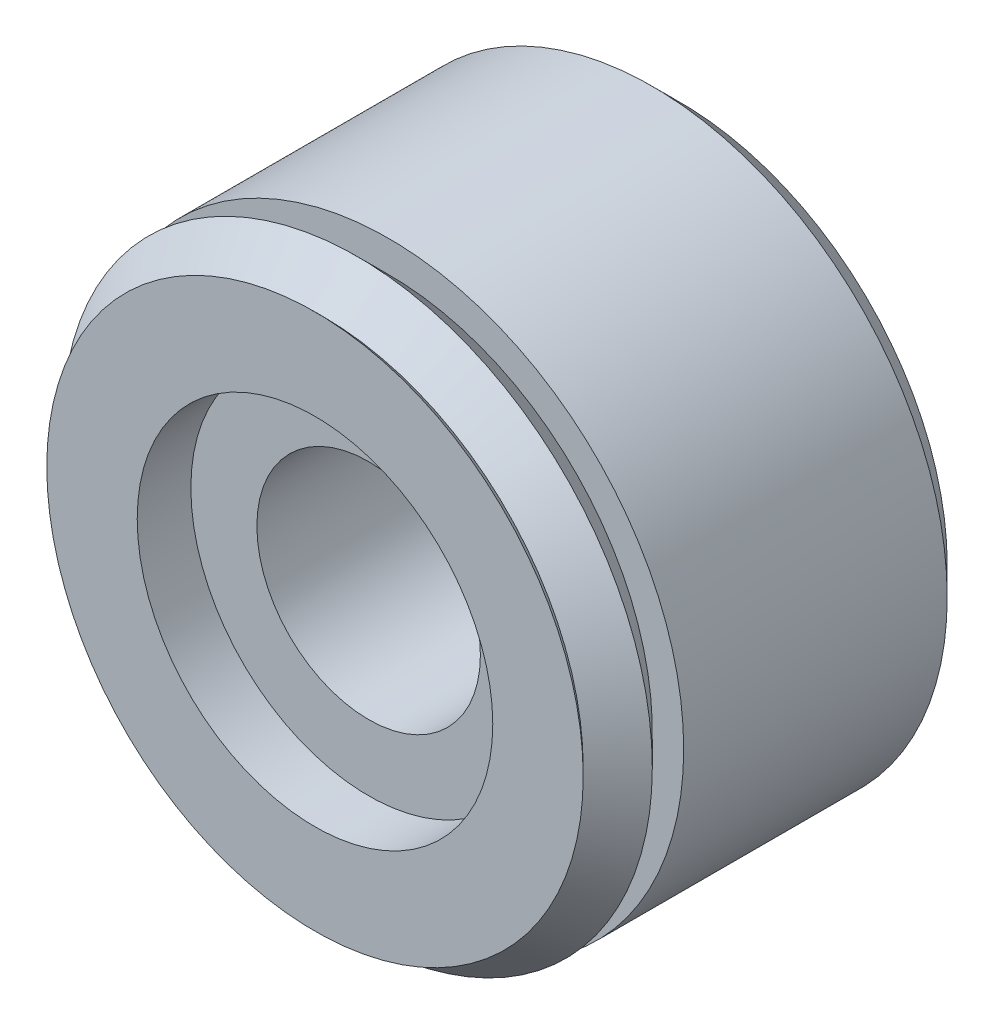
ISO-10303-21;
HEADER;
FILE_DESCRIPTION(('STEP AP214'),'2;1');
FILE_NAME('part.step','',(''),(''),'','','');
FILE_SCHEMA(('AUTOMOTIVE_DESIGN { 1 0 10303 214 1 1 1 1 }'));
ENDSEC;
DATA;
#1=APPLICATION_CONTEXT('core data for automotive mechanical design processes');
#2=APPLICATION_PROTOCOL_DEFINITION('international standard','automotive_design',2000,#1);
#3=PRODUCT_CONTEXT('',#1,'mechanical');
#4=PRODUCT('Part','Part','',(#3));
#5=PRODUCT_RELATED_PRODUCT_CATEGORY('part','',(#4));
#6=PRODUCT_DEFINITION_FORMATION('','',#4);
#7=PRODUCT_DEFINITION_CONTEXT('part definition',#1,'design');
#8=PRODUCT_DEFINITION('design','',#6,#7);
#9=PRODUCT_DEFINITION_SHAPE('','',#8);
#10=(LENGTH_UNIT() NAMED_UNIT(*) SI_UNIT(.MILLI.,.METRE.));
#11=(NAMED_UNIT(*) PLANE_ANGLE_UNIT() SI_UNIT($,.RADIAN.));
#12=(NAMED_UNIT(*) SI_UNIT($,.STERADIAN.) SOLID_ANGLE_UNIT());
#13=UNCERTAINTY_MEASURE_WITH_UNIT(LENGTH_MEASURE(1.E-05),#10,'distance_accuracy_value','');
#14=(GEOMETRIC_REPRESENTATION_CONTEXT(3) GLOBAL_UNCERTAINTY_ASSIGNED_CONTEXT((#13)) GLOBAL_UNIT_ASSIGNED_CONTEXT((#10,
#11,#12)) REPRESENTATION_CONTEXT('',''));
#15=CARTESIAN_POINT('',(0.,0.,0.));
#16=DIRECTION('',(0.,0.,1.));
#17=DIRECTION('',(1.,0.,0.));
#18=AXIS2_PLACEMENT_3D('',#15,#16,#17);
#19=CARTESIAN_POINT('',(0.,0.,-10.373614));
#20=DIRECTION('',(0.,0.,1.));
#21=DIRECTION('',(1.,0.,0.));
#22=AXIS2_PLACEMENT_3D('',#19,#20,#21);
#23=CYLINDRICAL_SURFACE('',#22,3.175);
#24=CARTESIAN_POINT('',(0.,0.,-10.373614));
#25=DIRECTION('',(0.,0.,-1.));
#26=DIRECTION('',(-1.,0.,0.));
#27=AXIS2_PLACEMENT_3D('',#24,#25,#26);
#28=CIRCLE('',#27,3.175);
#29=CARTESIAN_POINT('',(-3.175,0.,-10.373614));
#30=VERTEX_POINT('',#29);
#31=EDGE_CURVE('E62',#30,#30,#28,.T.);
#32=ORIENTED_EDGE('',*,*,#31,.T.);
#33=EDGE_LOOP('',(#32));
#34=FACE_BOUND('',#33,.T.);
#35=CARTESIAN_POINT('',(0.,0.,-1.524));
#36=DIRECTION('',(0.,0.,1.));
#37=DIRECTION('',(1.,0.,0.));
#38=AXIS2_PLACEMENT_3D('',#35,#36,#37);
#39=CIRCLE('',#38,3.175);
#40=CARTESIAN_POINT('',(3.175,0.,-1.524));
#41=VERTEX_POINT('',#40);
#42=EDGE_CURVE('E37',#41,#41,#39,.T.);
#43=ORIENTED_EDGE('',*,*,#42,.T.);
#44=EDGE_LOOP('',(#43));
#45=FACE_BOUND('',#44,.T.);
#46=ADVANCED_FACE('F33',(#34,#45),#23,.F.);
#47=CARTESIAN_POINT('',(0.,0.,0.));
#48=DIRECTION('',(0.,0.,1.));
#49=DIRECTION('',(1.,0.,0.));
#50=AXIS2_PLACEMENT_3D('',#47,#48,#49);
#51=PLANE('',#50);
#52=CARTESIAN_POINT('',(0.,0.,0.));
#53=DIRECTION('',(0.,0.,1.));
#54=DIRECTION('',(1.,0.,0.));
#55=AXIS2_PLACEMENT_3D('',#52,#53,#54);
#56=CIRCLE('',#55,5.05092480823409);
#57=CARTESIAN_POINT('',(5.05092480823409,0.,0.));
#58=VERTEX_POINT('',#57);
#59=EDGE_CURVE('E65',#58,#58,#56,.T.);
#60=ORIENTED_EDGE('',*,*,#59,.F.);
#61=EDGE_LOOP('',(#60));
#62=FACE_BOUND('',#61,.T.);
#63=CARTESIAN_POINT('',(0.,0.,0.));
#64=DIRECTION('',(0.,0.,-1.));
#65=DIRECTION('',(-1.,0.,0.));
#66=AXIS2_PLACEMENT_3D('',#63,#64,#65);
#67=CIRCLE('',#66,7.62);
#68=CARTESIAN_POINT('',(-7.62,0.,0.));
#69=VERTEX_POINT('',#68);
#70=EDGE_CURVE('E45',#69,#69,#67,.T.);
#71=ORIENTED_EDGE('',*,*,#70,.F.);
#72=EDGE_LOOP('',(#71));
#73=FACE_BOUND('',#72,.T.);
#74=ADVANCED_FACE('F86',(#62,#73),#51,.T.);
#75=CARTESIAN_POINT('',(0.,8.38199999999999,-10.373614));
#76=DIRECTION('',(0.,0.,-1.));
#77=DIRECTION('',(-1.,0.,0.));
#78=AXIS2_PLACEMENT_3D('',#75,#76,#77);
#79=PLANE('',#78);
#80=CARTESIAN_POINT('',(0.,0.,-10.373614));
#81=DIRECTION('',(0.,0.,-1.));
#82=DIRECTION('',(-1.,0.,0.));
#83=AXIS2_PLACEMENT_3D('',#80,#81,#82);
#84=CIRCLE('',#83,7.58825);
#85=CARTESIAN_POINT('',(7.58825,0.,-10.373614));
#86=VERTEX_POINT('',#85);
#87=EDGE_CURVE('E41',#86,#86,#84,.T.);
#88=ORIENTED_EDGE('',*,*,#87,.T.);
#89=EDGE_LOOP('',(#88));
#90=FACE_BOUND('',#89,.T.);
#91=ORIENTED_EDGE('',*,*,#31,.F.);
#92=EDGE_LOOP('',(#91));
#93=FACE_BOUND('',#92,.T.);
#94=ADVANCED_FACE('F92',(#90,#93),#79,.T.);
#95=CARTESIAN_POINT('',(0.,0.,-0.219709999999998));
#96=DIRECTION('',(0.,0.,1.));
#97=DIRECTION('',(1.,0.,0.));
#98=AXIS2_PLACEMENT_3D('',#95,#96,#97);
#99=CONICAL_SURFACE('',#98,7.40029,0.785398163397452);
#100=ORIENTED_EDGE('',*,*,#70,.T.);
#101=EDGE_LOOP('',(#100));
#102=FACE_BOUND('',#101,.T.);
#103=CARTESIAN_POINT('',(0.,0.,-0.219709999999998));
#104=DIRECTION('',(0.,0.,-1.));
#105=DIRECTION('',(-1.,0.,0.));
#106=AXIS2_PLACEMENT_3D('',#103,#104,#105);
#107=CIRCLE('',#106,7.40029);
#108=CARTESIAN_POINT('',(-7.40029,0.,-0.219709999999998));
#109=VERTEX_POINT('',#108);
#110=EDGE_CURVE('E50',#109,#109,#107,.T.);
#111=ORIENTED_EDGE('',*,*,#110,.F.);
#112=EDGE_LOOP('',(#111));
#113=FACE_BOUND('',#112,.T.);
#114=ADVANCED_FACE('F97',(#102,#113),#99,.T.);
#115=CARTESIAN_POINT('',(0.,0.,-1.20141999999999));
#116=DIRECTION('',(0.,0.,-1.));
#117=DIRECTION('',(-1.,0.,0.));
#118=AXIS2_PLACEMENT_3D('',#115,#116,#117);
#119=CONICAL_SURFACE('',#118,8.38199999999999,0.785398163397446);
#120=ORIENTED_EDGE('',*,*,#110,.T.);
#121=EDGE_LOOP('',(#120));
#122=FACE_BOUND('',#121,.T.);
#123=CARTESIAN_POINT('',(0.,0.,-1.20141999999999));
#124=DIRECTION('',(0.,0.,-1.));
#125=DIRECTION('',(-1.,0.,0.));
#126=AXIS2_PLACEMENT_3D('',#123,#124,#125);
#127=CIRCLE('',#126,8.38199999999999);
#128=CARTESIAN_POINT('',(-8.38199999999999,0.,-1.20141999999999));
#129=VERTEX_POINT('',#128);
#130=EDGE_CURVE('E53',#129,#129,#127,.T.);
#131=ORIENTED_EDGE('',*,*,#130,.F.);
#132=EDGE_LOOP('',(#131));
#133=FACE_BOUND('',#132,.T.);
#134=ADVANCED_FACE('F109',(#122,#133),#119,.T.);
#135=CARTESIAN_POINT('',(0.,0.,-2.093214));
#136=DIRECTION('',(0.,0.,1.));
#137=DIRECTION('',(1.,0.,0.));
#138=AXIS2_PLACEMENT_3D('',#135,#136,#137);
#139=CONICAL_SURFACE('',#138,7.49020599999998,0.785398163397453);
#140=ORIENTED_EDGE('',*,*,#130,.T.);
#141=EDGE_LOOP('',(#140));
#142=FACE_BOUND('',#141,.T.);
#143=CARTESIAN_POINT('',(0.,0.,-2.093214));
#144=DIRECTION('',(0.,0.,-1.));
#145=DIRECTION('',(-1.,0.,0.));
#146=AXIS2_PLACEMENT_3D('',#143,#144,#145);
#147=CIRCLE('',#146,7.49020599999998);
#148=CARTESIAN_POINT('',(-7.49020599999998,0.,-2.093214));
#149=VERTEX_POINT('',#148);
#150=EDGE_CURVE('E56',#149,#149,#147,.T.);
#151=ORIENTED_EDGE('',*,*,#150,.F.);
#152=EDGE_LOOP('',(#151));
#153=FACE_BOUND('',#152,.T.);
#154=ADVANCED_FACE('F105',(#142,#153),#139,.T.);
#155=CARTESIAN_POINT('',(0.,7.49020599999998,-2.093214));
#156=DIRECTION('',(0.,0.,1.));
#157=DIRECTION('',(1.,0.,0.));
#158=AXIS2_PLACEMENT_3D('',#155,#156,#157);
#159=PLANE('',#158);
#160=ORIENTED_EDGE('',*,*,#150,.T.);
#161=EDGE_LOOP('',(#160));
#162=FACE_BOUND('',#161,.T.);
#163=CARTESIAN_POINT('',(0.,0.,-2.093214));
#164=DIRECTION('',(0.,0.,-1.));
#165=DIRECTION('',(-1.,0.,0.));
#166=AXIS2_PLACEMENT_3D('',#163,#164,#165);
#167=CIRCLE('',#166,8.38199999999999);
#168=CARTESIAN_POINT('',(-8.38199999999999,0.,-2.093214));
#169=VERTEX_POINT('',#168);
#170=EDGE_CURVE('E59',#169,#169,#167,.T.);
#171=ORIENTED_EDGE('',*,*,#170,.F.);
#172=EDGE_LOOP('',(#171));
#173=FACE_BOUND('',#172,.T.);
#174=ADVANCED_FACE('F102',(#162,#173),#159,.T.);
#175=CARTESIAN_POINT('',(0.,0.,-71.2941240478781));
#176=DIRECTION('',(0.,0.,-1.));
#177=DIRECTION('',(-1.,0.,0.));
#178=AXIS2_PLACEMENT_3D('',#175,#176,#177);
#179=CYLINDRICAL_SURFACE('',#178,8.38199999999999);
#180=CARTESIAN_POINT('',(0.,0.,-9.579864));
#181=DIRECTION('',(0.,0.,-1.));
#182=DIRECTION('',(-1.,0.,0.));
#183=AXIS2_PLACEMENT_3D('',#180,#181,#182);
#184=CIRCLE('',#183,8.38199999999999);
#185=CARTESIAN_POINT('',(8.38199999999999,0.,-9.579864));
#186=VERTEX_POINT('',#185);
#187=EDGE_CURVE('E10',#186,#186,#184,.F.);
#188=ORIENTED_EDGE('',*,*,#187,.T.);
#189=EDGE_LOOP('',(#188));
#190=FACE_BOUND('',#189,.T.);
#191=ORIENTED_EDGE('',*,*,#170,.T.);
#192=EDGE_LOOP('',(#191));
#193=FACE_BOUND('',#192,.T.);
#194=ADVANCED_FACE('F99',(#190,#193),#179,.T.);
#195=CARTESIAN_POINT('',(0.,0.,-10.373614));
#196=DIRECTION('',(0.,0.,1.));
#197=DIRECTION('',(1.,0.,0.));
#198=AXIS2_PLACEMENT_3D('',#195,#196,#197);
#199=CONICAL_SURFACE('',#198,7.58825,0.785398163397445);
#200=CARTESIAN_POINT('',(8.38199999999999,0.,-9.579864));
#201=CARTESIAN_POINT('',(8.37373177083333,0.,-9.58813222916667));
#202=CARTESIAN_POINT('',(8.36546354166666,0.,-9.59640045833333));
#203=CARTESIAN_POINT('',(8.34892708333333,0.,-9.61293691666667));
#204=CARTESIAN_POINT('',(8.34065885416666,0.,-9.62120514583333));
#205=CARTESIAN_POINT('',(8.32412239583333,0.,-9.63774160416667));
#206=CARTESIAN_POINT('',(8.31585416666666,0.,-9.64600983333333));
#207=CARTESIAN_POINT('',(8.29931770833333,0.,-9.66254629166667));
#208=CARTESIAN_POINT('',(8.29104947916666,0.,-9.67081452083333));
#209=CARTESIAN_POINT('',(8.27451302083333,0.,-9.68735097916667));
#210=CARTESIAN_POINT('',(8.26624479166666,0.,-9.69561920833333));
#211=CARTESIAN_POINT('',(8.24970833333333,0.,-9.71215566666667));
#212=CARTESIAN_POINT('',(8.24144010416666,0.,-9.72042389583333));
#213=CARTESIAN_POINT('',(8.22490364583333,0.,-9.73696035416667));
#214=CARTESIAN_POINT('',(8.21663541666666,0.,-9.74522858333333));
#215=CARTESIAN_POINT('',(8.20009895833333,0.,-9.76176504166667));
#216=CARTESIAN_POINT('',(8.19183072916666,0.,-9.77003327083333));
#217=CARTESIAN_POINT('',(8.17529427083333,0.,-9.78656972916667));
#218=CARTESIAN_POINT('',(8.16702604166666,0.,-9.79483795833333));
#219=CARTESIAN_POINT('',(8.15048958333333,0.,-9.81137441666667));
#220=CARTESIAN_POINT('',(8.14222135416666,0.,-9.81964264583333));
#221=CARTESIAN_POINT('',(8.12568489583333,0.,-9.83617910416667));
#222=CARTESIAN_POINT('',(8.11741666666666,0.,-9.84444733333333));
#223=CARTESIAN_POINT('',(8.10088020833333,0.,-9.86098379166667));
#224=CARTESIAN_POINT('',(8.09261197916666,0.,-9.86925202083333));
#225=CARTESIAN_POINT('',(8.07607552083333,0.,-9.88578847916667));
#226=CARTESIAN_POINT('',(8.06780729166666,0.,-9.89405670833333));
#227=CARTESIAN_POINT('',(8.05127083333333,0.,-9.91059316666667));
#228=CARTESIAN_POINT('',(8.04300260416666,0.,-9.91886139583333));
#229=CARTESIAN_POINT('',(8.02646614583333,0.,-9.93539785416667));
#230=CARTESIAN_POINT('',(8.01819791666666,0.,-9.94366608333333));
#231=CARTESIAN_POINT('',(8.00166145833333,0.,-9.96020254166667));
#232=CARTESIAN_POINT('',(7.99339322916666,0.,-9.96847077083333));
#233=CARTESIAN_POINT('',(7.97685677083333,0.,-9.98500722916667));
#234=CARTESIAN_POINT('',(7.96858854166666,0.,-9.99327545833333));
#235=CARTESIAN_POINT('',(7.95205208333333,0.,-10.0098119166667));
#236=CARTESIAN_POINT('',(7.94378385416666,0.,-10.0180801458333));
#237=CARTESIAN_POINT('',(7.92724739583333,0.,-10.0346166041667));
#238=CARTESIAN_POINT('',(7.91897916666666,0.,-10.0428848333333));
#239=CARTESIAN_POINT('',(7.90244270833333,0.,-10.0594212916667));
#240=CARTESIAN_POINT('',(7.89417447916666,0.,-10.0676895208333));
#241=CARTESIAN_POINT('',(7.87763802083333,0.,-10.0842259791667));
#242=CARTESIAN_POINT('',(7.86936979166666,0.,-10.0924942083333));
#243=CARTESIAN_POINT('',(7.85283333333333,0.,-10.1090306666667));
#244=CARTESIAN_POINT('',(7.84456510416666,0.,-10.1172988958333));
#245=CARTESIAN_POINT('',(7.82802864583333,0.,-10.1338353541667));
#246=CARTESIAN_POINT('',(7.81976041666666,0.,-10.1421035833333));
#247=CARTESIAN_POINT('',(7.80322395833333,0.,-10.1586400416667));
#248=CARTESIAN_POINT('',(7.79495572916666,0.,-10.1669082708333));
#249=CARTESIAN_POINT('',(7.77841927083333,0.,-10.1834447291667));
#250=CARTESIAN_POINT('',(7.77015104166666,0.,-10.1917129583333));
#251=CARTESIAN_POINT('',(7.75361458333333,0.,-10.2082494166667));
#252=CARTESIAN_POINT('',(7.74534635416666,0.,-10.2165176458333));
#253=CARTESIAN_POINT('',(7.72880989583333,0.,-10.2330541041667));
#254=CARTESIAN_POINT('',(7.72054166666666,0.,-10.2413223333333));
#255=CARTESIAN_POINT('',(7.70400520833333,0.,-10.2578587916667));
#256=CARTESIAN_POINT('',(7.69573697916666,0.,-10.2661270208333));
#257=CARTESIAN_POINT('',(7.67920052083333,0.,-10.2826634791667));
#258=CARTESIAN_POINT('',(7.67093229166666,0.,-10.2909317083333));
#259=CARTESIAN_POINT('',(7.65439583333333,0.,-10.3074681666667));
#260=CARTESIAN_POINT('',(7.64612760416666,0.,-10.3157363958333));
#261=CARTESIAN_POINT('',(7.62959114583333,0.,-10.3322728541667));
#262=CARTESIAN_POINT('',(7.62132291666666,0.,-10.3405410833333));
#263=CARTESIAN_POINT('',(7.60478645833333,0.,-10.3570775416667));
#264=CARTESIAN_POINT('',(7.59651822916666,0.,-10.3653457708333));
#265=CARTESIAN_POINT('',(7.58825,0.,-10.373614));
#266=B_SPLINE_CURVE_WITH_KNOTS('',3,(#200,#201,#202,#203,#204,#205,#206,#207,#208,#209,#210,
#211,#212,#213,#214,#215,#216,#217,#218,#219,#220,#221,#222,#223,#224,#225,#226,#227,#228,#229,
#230,#231,#232,#233,#234,#235,#236,#237,#238,#239,#240,#241,#242,#243,#244,#245,#246,#247,#248,
#249,#250,#251,#252,#253,#254,#255,#256,#257,#258,#259,#260,#261,#262,#263,#264,#265),
.UNSPECIFIED.,.F.,.F.,(4,2,2,2,2,2,2,2,2,2,2,2,2,2,2,2,2,2,2,2,2,2,2,2,2,2,2,2,2,2,2,2,4),(0.,
0.035079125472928,0.0701582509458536,0.10523737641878,0.140316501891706,0.175395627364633,
0.21047475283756,0.245553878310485,0.280633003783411,0.315712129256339,0.350791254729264,
0.38587038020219,0.420949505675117,0.456028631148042,0.491107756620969,0.526186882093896,
0.561266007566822,0.596345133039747,0.631424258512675,0.666503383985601,0.701582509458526,
0.736661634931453,0.77174076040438,0.806819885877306,0.841899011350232,0.876978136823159,
0.912057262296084,0.947136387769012,0.982215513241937,1.01729463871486,1.05237376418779,
1.08745288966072,1.12253201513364),.UNSPECIFIED.);
#267=EDGE_CURVE('BSEAM35',#186,#86,#266,.T.);
#268=ORIENTED_EDGE('',*,*,#187,.F.);
#269=ORIENTED_EDGE('',*,*,#87,.F.);
#270=ORIENTED_EDGE('',*,*,#267,.T.);
#271=ORIENTED_EDGE('',*,*,#267,.F.);
#272=EDGE_LOOP('',(#268,#270,#269,#271));
#273=FACE_BOUND('',#272,.T.);
#274=ADVANCED_FACE('F35',(#273),#199,.T.);
#275=CARTESIAN_POINT('',(0.,0.,-1.524));
#276=DIRECTION('',(0.,0.,1.));
#277=DIRECTION('',(1.,0.,0.));
#278=AXIS2_PLACEMENT_3D('',#275,#276,#277);
#279=CYLINDRICAL_SURFACE('',#278,5.05092480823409);
#280=CARTESIAN_POINT('',(0.,0.,-1.524));
#281=DIRECTION('',(0.,0.,1.));
#282=DIRECTION('',(1.,0.,0.));
#283=AXIS2_PLACEMENT_3D('',#280,#281,#282);
#284=CIRCLE('',#283,5.05092480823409);
#285=CARTESIAN_POINT('',(5.05092480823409,0.,-1.524));
#286=VERTEX_POINT('',#285);
#287=EDGE_CURVE('E68',#286,#286,#284,.T.);
#288=ORIENTED_EDGE('',*,*,#287,.F.);
#289=EDGE_LOOP('',(#288));
#290=FACE_BOUND('',#289,.T.);
#291=ORIENTED_EDGE('',*,*,#59,.T.);
#292=EDGE_LOOP('',(#291));
#293=FACE_BOUND('',#292,.T.);
#294=ADVANCED_FACE('F78',(#290,#293),#279,.F.);
#295=CARTESIAN_POINT('',(0.,0.,-1.524));
#296=DIRECTION('',(0.,0.,1.));
#297=DIRECTION('',(1.,0.,0.));
#298=AXIS2_PLACEMENT_3D('',#295,#296,#297);
#299=PLANE('',#298);
#300=ORIENTED_EDGE('',*,*,#42,.F.);
#301=EDGE_LOOP('',(#300));
#302=FACE_BOUND('',#301,.T.);
#303=ORIENTED_EDGE('',*,*,#287,.T.);
#304=EDGE_LOOP('',(#303));
#305=FACE_BOUND('',#304,.T.);
#306=ADVANCED_FACE('F76',(#302,#305),#299,.T.);
#307=CLOSED_SHELL('',(#46,#74,#94,#114,#134,#154,#174,#194,#274,#294,#306));
#308=MANIFOLD_SOLID_BREP('B2',#307);
#309=ADVANCED_BREP_SHAPE_REPRESENTATION('',(#18,#308),#14);
#310=SHAPE_DEFINITION_REPRESENTATION(#9,#309);
ENDSEC;
END-ISO-10303-21;
